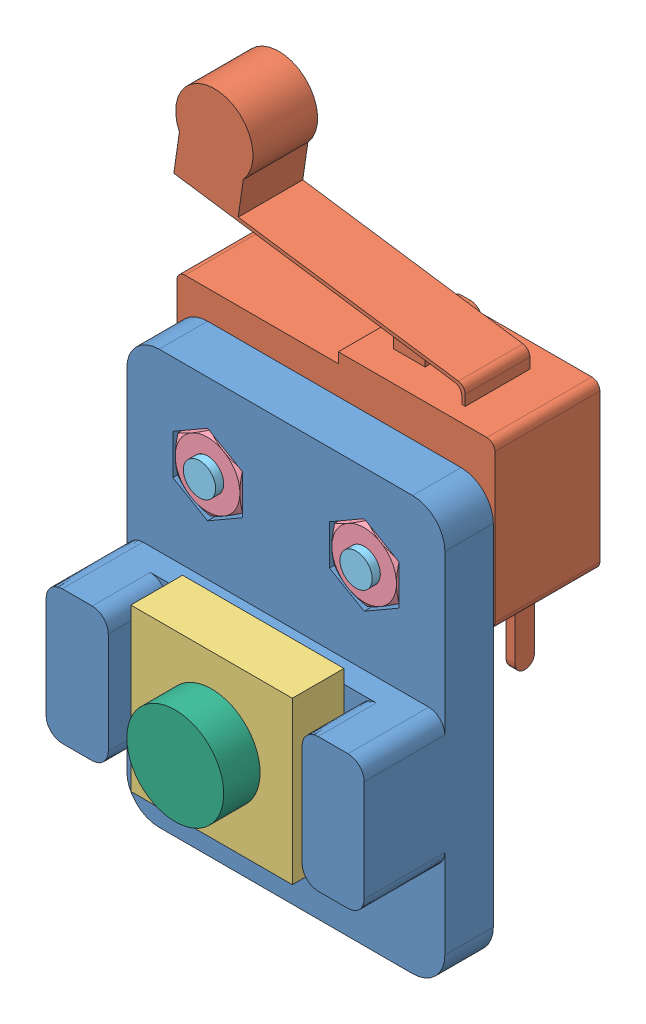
SolidWorks assembly switch_mount_A.SLDASM, configuration По умолчанию (file format 6000). Lengths in mm.
Overall size (20.89 37.34 17.92).
8 component instances, 6 part files, 16 mates.
Components (placement in the parent):
- switch_mount-1: switch_mount.SLDPRT [По умолчанию] at origin size (19.7 25.65 8)
- kw4A(S) microswitch-1: kw4A(S) microswitch.SLDPRT [Default] at (-18.9571 7.2494 0) x (0 0 -1) z (1 0 0) size (6.5 23.81 20.89)
- square nut thin grade b_din-1: square nut thin grade b_din.sldprt [Square nut DIN 562 M6 -N] at (8.966 0 4.4) x (-1 0 0) z (0 0 -1) size (10 10 3.2)
- hex nut style 1 gradeab_din-1: hex nut style 1 gradeab_din.sldprt [Hexagon Nut ISO 4032 - M2 - D - N] at (4.116 9.7744 3) size (4 4.62 1.6)
- hex nut style 1 gradeab_din-2: hex nut style 1 gradeab_din.sldprt [Hexagon Nut ISO 4032 - M2 - D - N] at (13.816 9.7744 3) x (0.5 0.866025 0) z (0 0 1) size (4 4.62 1.6)
- pan head cross recess screw_din_-1: pan head cross recess screw_din_.sldprt [ISO 7045 - M2 x 10 - Z --- 10N] at (13.816 9.7744 -8.1) x (0 0 1) z (-0.194535 0.980896 0) size (11.57 4 4)
- pan head cross recess screw_din_-3: pan head cross recess screw_din_.sldprt [ISO 7045 - M2 x 10 - Z --- 10N] at (4.116 9.7744 -8.1) x (0 0 1) z (-0.943448 0.331521 0) size (11.57 4 4)
- countersunk flat head cross recess screw_din_-2: countersunk flat head cross recess screw_din_.sldprt [ISO 7046-1 - M6 x 10 - Z --- 10N] at (8.966 0 -0.15) x (0 0 1) z (-0.973089 -0.23043 0) size (10 11.3 11.3)
Mates (geometry in assembly coordinates):
- Концентричный1: concentric anti-aligned: cylinder of switch_mount-1 through (13.816 9.7744 3) axis (0 0 -1) radius 1; cylinder of kw4A(S) microswitch-1 through (13.816 9.7744 -6.5) axis (0 0 1) radius 1.275
- Совпадение1: coincident anti-aligned: plane of switch_mount-1 through (0 0 0) normal (0 0 -1); plane of kw4A(S) microswitch-1 through (-0.284 16.2694 0) normal (0 0 1)
- Концентричный2: concentric anti-aligned: cylinder of switch_mount-1 through (4.116 9.7744 3) axis (0 0 -1) radius 1; cylinder of kw4A(S) microswitch-1 through (4.116 9.7744 -6.5) axis (0 0 1) radius 1.275
- Совпадение4: coincident anti-aligned: plane of switch_mount-1 through (0 0 4.4) normal (0 0 1); plane of square nut thin grade b_din-1 through (13.966 5 4.4) normal (0 0 -1)
- Параллельность1: parallel anti-aligned: plane of switch_mount-1 through (14.966 0 8) normal (-1 0 0); plane of square nut thin grade b_din-1 through (13.966 -5 7.6) normal (1 0 0)
- Концентричный7: concentric anti-aligned: cylinder of switch_mount-1 through (4.116 9.7744 3) axis (0 0 -1) radius 1; cylinder of hex nut style 1 gradeab_din-1 through (4.116 9.7744 1.4) axis (0 0 1) radius 0.8
- Концентричный8: concentric anti-aligned: cylinder of switch_mount-1 through (13.816 9.7744 3) axis (0 0 -1) radius 1; cylinder of hex nut style 1 gradeab_din-2 through (13.816 9.7744 1.4) axis (0 0 1) radius 0.8
- Параллельность2: parallel aligned: plane of switch_mount-1 through (18.816 0 3) normal (1 0 0); plane of hex nut style 1 gradeab_din-1 through (6.116 10.9291 1.4) normal (1 0 0)
- Параллельность3: parallel aligned: plane of switch_mount-1 through (18.816 0 3) normal (1 0 0); plane of hex nut style 1 gradeab_din-2 through (15.816 8.6197 1.4) normal (1 0 0)
- Совпадение7: coincident anti-aligned: plane of switch_mount-1 through (0 0 1.4) normal (0 0 1); plane of hex nut style 1 gradeab_din-1 through (4.116 12.0838 1.4) normal (0 0 -1)
- Совпадение8: coincident anti-aligned: plane of switch_mount-1 through (0 0 1.4) normal (0 0 1); plane of hex nut style 1 gradeab_din-2 through (11.816 10.9291 1.4) normal (0 0 -1)
- Концентричный9: concentric anti-aligned: cylinder of kw4A(S) microswitch-1 through (13.816 9.7744 -6.5) axis (0 0 1) radius 1.275; cylinder of pan head cross recess screw_din_-1 through (13.816 9.7744 -33.5) axis (0 0 -1) radius 1
- Совпадение9: coincident anti-aligned: plane of kw4A(S) microswitch-1 through (-0.284 16.2694 -6.5) normal (0 0 -1); plane of pan head cross recess screw_din_-1 through (14.7969 9.9689 -6.5) normal (0 0 1)
- Концентричный12: concentric anti-aligned: cylinder of kw4A(S) microswitch-1 through (4.116 9.7744 -6.5) axis (0 0 1) radius 1.275; cylinder of pan head cross recess screw_din_-3 through (4.116 9.7744 -33.5) axis (0 0 -1) radius 1
- Совпадение11: coincident anti-aligned: plane of kw4A(S) microswitch-1 through (-0.284 16.2694 -6.5) normal (0 0 -1); plane of pan head cross recess screw_din_-3 through (4.4475 10.7178 -6.5) normal (0 0 1)
- Совпадение13: coincident aligned: cone of switch_mount-1 through (8.966 0 0) axis (0 0 1); cone of countersunk flat head cross recess screw_din_-2 through (8.966 0 0.5) axis (0 0 1)
